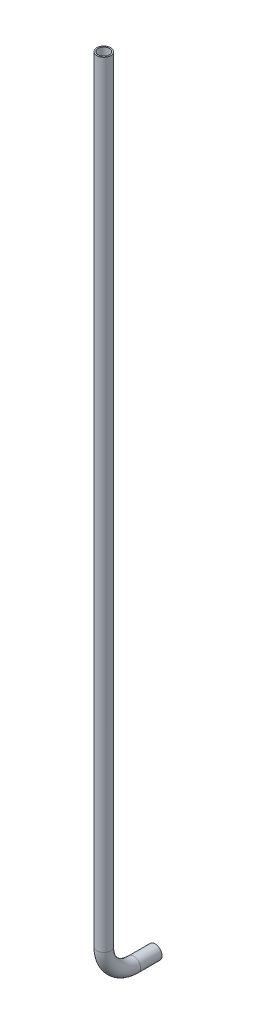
ISO-10303-21;
HEADER;
FILE_DESCRIPTION(('STEP AP214'),'2;1');
FILE_NAME('part.step','',(''),(''),'','','');
FILE_SCHEMA(('AUTOMOTIVE_DESIGN { 1 0 10303 214 1 1 1 1 }'));
ENDSEC;
DATA;
#1=APPLICATION_CONTEXT('core data for automotive mechanical design processes');
#2=APPLICATION_PROTOCOL_DEFINITION('international standard','automotive_design',2000,#1);
#3=PRODUCT_CONTEXT('',#1,'mechanical');
#4=PRODUCT('Part','Part','',(#3));
#5=PRODUCT_RELATED_PRODUCT_CATEGORY('part','',(#4));
#6=PRODUCT_DEFINITION_FORMATION('','',#4);
#7=PRODUCT_DEFINITION_CONTEXT('part definition',#1,'design');
#8=PRODUCT_DEFINITION('design','',#6,#7);
#9=PRODUCT_DEFINITION_SHAPE('','',#8);
#10=(LENGTH_UNIT() NAMED_UNIT(*) SI_UNIT(.MILLI.,.METRE.));
#11=(NAMED_UNIT(*) PLANE_ANGLE_UNIT() SI_UNIT($,.RADIAN.));
#12=(NAMED_UNIT(*) SI_UNIT($,.STERADIAN.) SOLID_ANGLE_UNIT());
#13=UNCERTAINTY_MEASURE_WITH_UNIT(LENGTH_MEASURE(1.E-05),#10,'distance_accuracy_value','');
#14=(GEOMETRIC_REPRESENTATION_CONTEXT(3) GLOBAL_UNCERTAINTY_ASSIGNED_CONTEXT((#13)) GLOBAL_UNIT_ASSIGNED_CONTEXT((#10,
#11,#12)) REPRESENTATION_CONTEXT('',''));
#15=CARTESIAN_POINT('',(0.,0.,0.));
#16=DIRECTION('',(0.,0.,1.));
#17=DIRECTION('',(1.,0.,0.));
#18=AXIS2_PLACEMENT_3D('',#15,#16,#17);
#19=CARTESIAN_POINT('',(0.,20.6375,35.3695));
#20=DIRECTION('',(0.,1.,0.));
#21=DIRECTION('',(0.,0.,1.));
#22=AXIS2_PLACEMENT_3D('',#19,#20,#21);
#23=CYLINDRICAL_SURFACE('',#22,4.7625);
#24=CARTESIAN_POINT('',(0.,20.6375,35.3695));
#25=DIRECTION('',(0.,1.,0.));
#26=DIRECTION('',(1.,0.,0.));
#27=AXIS2_PLACEMENT_3D('',#24,#25,#26);
#28=CIRCLE('',#27,4.7625);
#29=CARTESIAN_POINT('',(0.,20.6375,40.132));
#30=VERTEX_POINT('',#29);
#31=EDGE_CURVE('E43',#30,#30,#28,.T.);
#32=ORIENTED_EDGE('',*,*,#31,.T.);
#33=EDGE_LOOP('',(#32));
#34=FACE_BOUND('',#33,.T.);
#35=CARTESIAN_POINT('',(0.,554.0375,35.3695));
#36=DIRECTION('',(0.,1.,0.));
#37=DIRECTION('',(1.,0.,0.));
#38=AXIS2_PLACEMENT_3D('',#35,#36,#37);
#39=CIRCLE('',#38,4.7625);
#40=CARTESIAN_POINT('',(4.7625,554.0375,35.3695));
#41=VERTEX_POINT('',#40);
#42=EDGE_CURVE('E10',#41,#41,#39,.T.);
#43=ORIENTED_EDGE('',*,*,#42,.F.);
#44=EDGE_LOOP('',(#43));
#45=FACE_BOUND('',#44,.T.);
#46=ADVANCED_FACE('F33',(#34,#45),#23,.T.);
#47=CARTESIAN_POINT('',(0.,20.6375,35.3695));
#48=DIRECTION('',(0.,1.,0.));
#49=DIRECTION('',(0.,0.,1.));
#50=AXIS2_PLACEMENT_3D('',#47,#48,#49);
#51=CYLINDRICAL_SURFACE('',#50,3.8735);
#52=CARTESIAN_POINT('',(0.,20.6375,35.3695));
#53=DIRECTION('',(0.,1.,0.));
#54=DIRECTION('',(1.,0.,0.));
#55=AXIS2_PLACEMENT_3D('',#52,#53,#54);
#56=CIRCLE('',#55,3.8735);
#57=CARTESIAN_POINT('',(0.,20.6375,39.243));
#58=VERTEX_POINT('',#57);
#59=EDGE_CURVE('E47',#58,#58,#56,.T.);
#60=ORIENTED_EDGE('',*,*,#59,.F.);
#61=EDGE_LOOP('',(#60));
#62=FACE_BOUND('',#61,.T.);
#63=CARTESIAN_POINT('',(0.,554.0375,35.3695));
#64=DIRECTION('',(0.,1.,0.));
#65=DIRECTION('',(1.,0.,0.));
#66=AXIS2_PLACEMENT_3D('',#63,#64,#65);
#67=CIRCLE('',#66,3.8735);
#68=CARTESIAN_POINT('',(3.8735,554.0375,35.3695));
#69=VERTEX_POINT('',#68);
#70=EDGE_CURVE('E39',#69,#69,#67,.T.);
#71=ORIENTED_EDGE('',*,*,#70,.T.);
#72=EDGE_LOOP('',(#71));
#73=FACE_BOUND('',#72,.T.);
#74=ADVANCED_FACE('F75',(#62,#73),#51,.F.);
#75=CARTESIAN_POINT('',(0.,20.6375,14.732));
#76=DIRECTION('',(-1.,0.,0.));
#77=DIRECTION('',(0.,0.,1.));
#78=AXIS2_PLACEMENT_3D('',#75,#76,#77);
#79=TOROIDAL_SURFACE('',#78,20.6375,4.7625);
#80=CARTESIAN_POINT('',(0.,0.,14.732));
#81=DIRECTION('',(0.,0.,1.));
#82=DIRECTION('',(1.,0.,0.));
#83=AXIS2_PLACEMENT_3D('',#80,#81,#82);
#84=CIRCLE('',#83,4.7625);
#85=CARTESIAN_POINT('',(0.,-4.7625,14.732));
#86=VERTEX_POINT('',#85);
#87=EDGE_CURVE('E52',#86,#86,#84,.T.);
#88=CARTESIAN_POINT('',(0.,20.6375,14.732));
#89=DIRECTION('',(-1.,0.,0.));
#90=DIRECTION('',(0.,0.,1.));
#91=AXIS2_PLACEMENT_3D('',#88,#89,#90);
#92=CIRCLE('',#91,25.4);
#93=EDGE_CURVE('',#86,#30,#92,.T.);
#94=ORIENTED_EDGE('',*,*,#87,.T.);
#95=ORIENTED_EDGE('',*,*,#31,.F.);
#96=ORIENTED_EDGE('',*,*,#93,.T.);
#97=ORIENTED_EDGE('',*,*,#93,.F.);
#98=EDGE_LOOP('',(#94,#96,#95,#97));
#99=FACE_BOUND('',#98,.T.);
#100=ADVANCED_FACE('F71',(#99),#79,.T.);
#101=CARTESIAN_POINT('',(0.,20.6375,14.732));
#102=DIRECTION('',(-1.,0.,0.));
#103=DIRECTION('',(0.,0.,1.));
#104=AXIS2_PLACEMENT_3D('',#101,#102,#103);
#105=TOROIDAL_SURFACE('',#104,20.6375,3.8735);
#106=CARTESIAN_POINT('',(0.,0.,14.732));
#107=DIRECTION('',(0.,0.,1.));
#108=DIRECTION('',(1.,0.,0.));
#109=AXIS2_PLACEMENT_3D('',#106,#107,#108);
#110=CIRCLE('',#109,3.8735);
#111=CARTESIAN_POINT('',(0.,-3.87350000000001,14.732));
#112=VERTEX_POINT('',#111);
#113=EDGE_CURVE('E56',#112,#112,#110,.T.);
#114=CARTESIAN_POINT('',(0.,20.6375,14.732));
#115=DIRECTION('',(-1.,0.,0.));
#116=DIRECTION('',(0.,0.,1.));
#117=AXIS2_PLACEMENT_3D('',#114,#115,#116);
#118=CIRCLE('',#117,24.511);
#119=EDGE_CURVE('',#112,#58,#118,.T.);
#120=ORIENTED_EDGE('',*,*,#113,.F.);
#121=ORIENTED_EDGE('',*,*,#59,.T.);
#122=ORIENTED_EDGE('',*,*,#119,.T.);
#123=ORIENTED_EDGE('',*,*,#119,.F.);
#124=EDGE_LOOP('',(#120,#122,#121,#123));
#125=FACE_BOUND('',#124,.T.);
#126=ADVANCED_FACE('F68',(#125),#105,.F.);
#127=CARTESIAN_POINT('',(0.,0.,14.732));
#128=DIRECTION('',(0.,0.,-1.));
#129=DIRECTION('',(0.,1.,0.));
#130=AXIS2_PLACEMENT_3D('',#127,#128,#129);
#131=CYLINDRICAL_SURFACE('',#130,3.8735);
#132=ORIENTED_EDGE('',*,*,#113,.T.);
#133=EDGE_LOOP('',(#132));
#134=FACE_BOUND('',#133,.T.);
#135=CARTESIAN_POINT('',(0.,0.,0.));
#136=DIRECTION('',(0.,0.,1.));
#137=DIRECTION('',(1.,0.,0.));
#138=AXIS2_PLACEMENT_3D('',#135,#136,#137);
#139=CIRCLE('',#138,3.8735);
#140=CARTESIAN_POINT('',(3.8735,0.,0.));
#141=VERTEX_POINT('',#140);
#142=EDGE_CURVE('E57',#141,#141,#139,.T.);
#143=ORIENTED_EDGE('',*,*,#142,.F.);
#144=EDGE_LOOP('',(#143));
#145=FACE_BOUND('',#144,.T.);
#146=ADVANCED_FACE('F65',(#134,#145),#131,.F.);
#147=CARTESIAN_POINT('',(0.,0.,14.732));
#148=DIRECTION('',(0.,0.,-1.));
#149=DIRECTION('',(0.,1.,0.));
#150=AXIS2_PLACEMENT_3D('',#147,#148,#149);
#151=CYLINDRICAL_SURFACE('',#150,4.7625);
#152=ORIENTED_EDGE('',*,*,#87,.F.);
#153=EDGE_LOOP('',(#152));
#154=FACE_BOUND('',#153,.T.);
#155=CARTESIAN_POINT('',(0.,0.,0.));
#156=DIRECTION('',(0.,0.,1.));
#157=DIRECTION('',(1.,0.,0.));
#158=AXIS2_PLACEMENT_3D('',#155,#156,#157);
#159=CIRCLE('',#158,4.7625);
#160=CARTESIAN_POINT('',(4.7625,0.,0.));
#161=VERTEX_POINT('',#160);
#162=EDGE_CURVE('E53',#161,#161,#159,.T.);
#163=ORIENTED_EDGE('',*,*,#162,.T.);
#164=EDGE_LOOP('',(#163));
#165=FACE_BOUND('',#164,.T.);
#166=ADVANCED_FACE('F87',(#154,#165),#151,.T.);
#167=CARTESIAN_POINT('',(0.,554.0375,35.3695));
#168=DIRECTION('',(0.,1.,0.));
#169=DIRECTION('',(1.,0.,0.));
#170=AXIS2_PLACEMENT_3D('',#167,#168,#169);
#171=PLANE('',#170);
#172=ORIENTED_EDGE('',*,*,#70,.F.);
#173=EDGE_LOOP('',(#172));
#174=FACE_BOUND('',#173,.T.);
#175=ORIENTED_EDGE('',*,*,#42,.T.);
#176=EDGE_LOOP('',(#175));
#177=FACE_BOUND('',#176,.T.);
#178=ADVANCED_FACE('F90',(#174,#177),#171,.T.);
#179=CARTESIAN_POINT('',(0.,0.,0.));
#180=DIRECTION('',(0.,0.,1.));
#181=DIRECTION('',(1.,0.,0.));
#182=AXIS2_PLACEMENT_3D('',#179,#180,#181);
#183=PLANE('',#182);
#184=ORIENTED_EDGE('',*,*,#142,.T.);
#185=EDGE_LOOP('',(#184));
#186=FACE_BOUND('',#185,.T.);
#187=ORIENTED_EDGE('',*,*,#162,.F.);
#188=EDGE_LOOP('',(#187));
#189=FACE_BOUND('',#188,.T.);
#190=ADVANCED_FACE('F92',(#186,#189),#183,.F.);
#191=CLOSED_SHELL('',(#46,#74,#100,#126,#146,#166,#178,#190));
#192=MANIFOLD_SOLID_BREP('B2',#191);
#193=ADVANCED_BREP_SHAPE_REPRESENTATION('',(#18,#192),#14);
#194=SHAPE_DEFINITION_REPRESENTATION(#9,#193);
ENDSEC;
END-ISO-10303-21;
